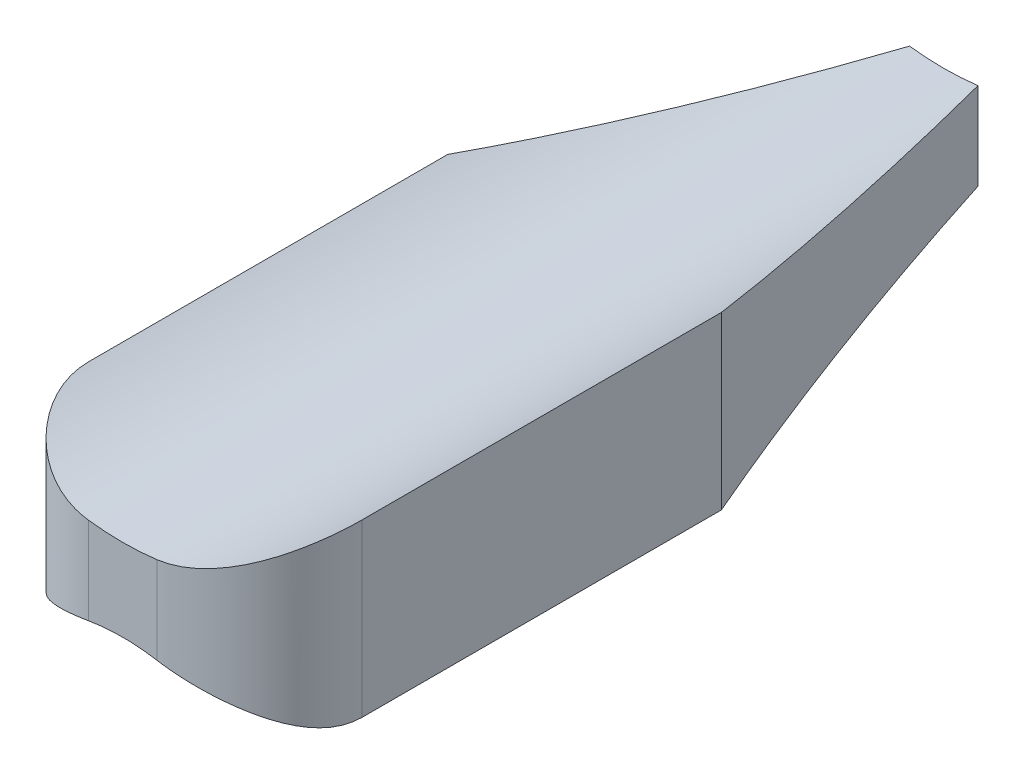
ISO-10303-21;
HEADER;
FILE_DESCRIPTION(('STEP AP214'),'2;1');
FILE_NAME('part.step','',(''),(''),'','','');
FILE_SCHEMA(('AUTOMOTIVE_DESIGN { 1 0 10303 214 1 1 1 1 }'));
ENDSEC;
DATA;
#1=APPLICATION_CONTEXT('core data for automotive mechanical design processes');
#2=APPLICATION_PROTOCOL_DEFINITION('international standard','automotive_design',2000,#1);
#3=PRODUCT_CONTEXT('',#1,'mechanical');
#4=PRODUCT('Part','Part','',(#3));
#5=PRODUCT_RELATED_PRODUCT_CATEGORY('part','',(#4));
#6=PRODUCT_DEFINITION_FORMATION('','',#4);
#7=PRODUCT_DEFINITION_CONTEXT('part definition',#1,'design');
#8=PRODUCT_DEFINITION('design','',#6,#7);
#9=PRODUCT_DEFINITION_SHAPE('','',#8);
#10=(LENGTH_UNIT() NAMED_UNIT(*) SI_UNIT(.MILLI.,.METRE.));
#11=(NAMED_UNIT(*) PLANE_ANGLE_UNIT() SI_UNIT($,.RADIAN.));
#12=(NAMED_UNIT(*) SI_UNIT($,.STERADIAN.) SOLID_ANGLE_UNIT());
#13=UNCERTAINTY_MEASURE_WITH_UNIT(LENGTH_MEASURE(1.E-05),#10,'distance_accuracy_value','');
#14=(GEOMETRIC_REPRESENTATION_CONTEXT(3) GLOBAL_UNCERTAINTY_ASSIGNED_CONTEXT((#13)) GLOBAL_UNIT_ASSIGNED_CONTEXT((#10,
#11,#12)) REPRESENTATION_CONTEXT('',''));
#15=CARTESIAN_POINT('',(0.,0.,0.));
#16=DIRECTION('',(0.,0.,1.));
#17=DIRECTION('',(1.,0.,0.));
#18=AXIS2_PLACEMENT_3D('',#15,#16,#17);
#19=CARTESIAN_POINT('',(0.,0.,304.8));
#20=DIRECTION('',(1.,0.,0.));
#21=DIRECTION('',(0.,0.,-1.));
#22=AXIS2_PLACEMENT_3D('',#19,#20,#21);
#23=PLANE('',#22);
#24=DIRECTION('',(0.,-1.,0.));
#25=VECTOR('',#24,1.);
#26=CARTESIAN_POINT('',(-1.07552855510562E-13,66.1597204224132,133.35));
#27=LINE('',#26,#25);
#28=CARTESIAN_POINT('',(-1.07552855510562E-13,63.5,133.35));
#29=VERTEX_POINT('',#28);
#30=CARTESIAN_POINT('',(-1.07552855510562E-13,0.,133.35));
#31=VERTEX_POINT('',#30);
#32=EDGE_CURVE('E104',#29,#31,#27,.T.);
#33=ORIENTED_EDGE('',*,*,#32,.T.);
#34=DIRECTION('',(0.,0.,-1.));
#35=VECTOR('',#34,1.);
#36=CARTESIAN_POINT('',(0.,0.,304.8));
#37=LINE('',#36,#35);
#38=CARTESIAN_POINT('',(0.,0.,266.7));
#39=VERTEX_POINT('',#38);
#40=EDGE_CURVE('E113',#39,#31,#37,.T.);
#41=ORIENTED_EDGE('',*,*,#40,.F.);
#42=DIRECTION('',(0.,-1.,0.));
#43=VECTOR('',#42,1.);
#44=CARTESIAN_POINT('',(0.,0.,266.7));
#45=LINE('',#44,#43);
#46=CARTESIAN_POINT('',(0.,63.5,266.7));
#47=VERTEX_POINT('',#46);
#48=EDGE_CURVE('E237',#39,#47,#45,.F.);
#49=ORIENTED_EDGE('',*,*,#48,.T.);
#50=DIRECTION('',(0.,0.,-1.));
#51=VECTOR('',#50,1.);
#52=CARTESIAN_POINT('',(0.,63.5,304.8));
#53=LINE('',#52,#51);
#54=EDGE_CURVE('E116',#47,#29,#53,.T.);
#55=ORIENTED_EDGE('',*,*,#54,.T.);
#56=EDGE_LOOP('',(#33,#41,#49,#55));
#57=FACE_BOUND('',#56,.T.);
#58=ADVANCED_FACE('F39',(#57),#23,.F.);
#59=CARTESIAN_POINT('',(101.6,0.,304.8));
#60=DIRECTION('',(-1.,0.,0.));
#61=DIRECTION('',(0.,0.,1.));
#62=AXIS2_PLACEMENT_3D('',#59,#60,#61);
#63=PLANE('',#62);
#64=DIRECTION('',(0.,-1.,0.));
#65=VECTOR('',#64,1.);
#66=CARTESIAN_POINT('',(101.6,66.1597204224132,133.35));
#67=LINE('',#66,#65);
#68=CARTESIAN_POINT('',(101.6,63.5,133.35));
#69=VERTEX_POINT('',#68);
#70=CARTESIAN_POINT('',(101.6,0.,133.35));
#71=VERTEX_POINT('',#70);
#72=EDGE_CURVE('E56',#69,#71,#67,.T.);
#73=ORIENTED_EDGE('',*,*,#72,.F.);
#74=DIRECTION('',(0.,0.,-1.));
#75=VECTOR('',#74,1.);
#76=CARTESIAN_POINT('',(101.6,63.5,304.8));
#77=LINE('',#76,#75);
#78=CARTESIAN_POINT('',(101.6,63.5,266.7));
#79=VERTEX_POINT('',#78);
#80=EDGE_CURVE('E133',#79,#69,#77,.T.);
#81=ORIENTED_EDGE('',*,*,#80,.F.);
#82=DIRECTION('',(0.,1.,0.));
#83=VECTOR('',#82,1.);
#84=CARTESIAN_POINT('',(101.6,0.,266.7));
#85=LINE('',#84,#83);
#86=CARTESIAN_POINT('',(101.6,0.,266.7));
#87=VERTEX_POINT('',#86);
#88=EDGE_CURVE('E183',#79,#87,#85,.F.);
#89=ORIENTED_EDGE('',*,*,#88,.T.);
#90=DIRECTION('',(0.,0.,-1.));
#91=VECTOR('',#90,1.);
#92=CARTESIAN_POINT('',(101.6,0.,304.8));
#93=LINE('',#92,#91);
#94=EDGE_CURVE('E125',#87,#71,#93,.T.);
#95=ORIENTED_EDGE('',*,*,#94,.T.);
#96=EDGE_LOOP('',(#73,#81,#89,#95));
#97=FACE_BOUND('',#96,.T.);
#98=ADVANCED_FACE('F192',(#97),#63,.F.);
#99=CARTESIAN_POINT('',(0.,0.,0.));
#100=DIRECTION('',(0.,0.,-1.));
#101=DIRECTION('',(-1.,0.,0.));
#102=AXIS2_PLACEMENT_3D('',#99,#100,#101);
#103=PLANE('',#102);
#104=CARTESIAN_POINT('',(50.8000000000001,-56.7961266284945,0.));
#105=DIRECTION('',(0.,0.,1.));
#106=DIRECTION('',(1.,0.,0.));
#107=AXIS2_PLACEMENT_3D('',#104,#105,#106);
#108=CIRCLE('',#107,76.2);
#109=CARTESIAN_POINT('',(63.5,18.3380866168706,0.));
#110=VERTEX_POINT('',#109);
#111=CARTESIAN_POINT('',(38.1,18.3380866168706,0.));
#112=VERTEX_POINT('',#111);
#113=EDGE_CURVE('E200',#110,#112,#108,.T.);
#114=ORIENTED_EDGE('',*,*,#113,.T.);
#115=DIRECTION('',(0.,-1.,0.));
#116=VECTOR('',#115,1.);
#117=CARTESIAN_POINT('',(38.1,66.1597204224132,0.));
#118=LINE('',#117,#116);
#119=CARTESIAN_POINT('',(38.1,50.6850560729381,0.));
#120=VERTEX_POINT('',#119);
#121=EDGE_CURVE('E63',#120,#112,#118,.T.);
#122=ORIENTED_EDGE('',*,*,#121,.F.);
#123=CARTESIAN_POINT('',(50.8,151.488181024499,0.));
#124=DIRECTION('',(0.,0.,1.));
#125=DIRECTION('',(1.,0.,0.));
#126=AXIS2_PLACEMENT_3D('',#123,#124,#125);
#127=CIRCLE('',#126,101.6);
#128=CARTESIAN_POINT('',(63.5,50.6850560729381,0.));
#129=VERTEX_POINT('',#128);
#130=EDGE_CURVE('E211',#120,#129,#127,.T.);
#131=ORIENTED_EDGE('',*,*,#130,.T.);
#132=DIRECTION('',(0.,-1.,0.));
#133=VECTOR('',#132,1.);
#134=CARTESIAN_POINT('',(63.5,66.1597204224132,0.));
#135=LINE('',#134,#133);
#136=EDGE_CURVE('E203',#129,#110,#135,.T.);
#137=ORIENTED_EDGE('',*,*,#136,.T.);
#138=EDGE_LOOP('',(#114,#122,#131,#137));
#139=FACE_BOUND('',#138,.T.);
#140=ADVANCED_FACE('F165',(#139),#103,.T.);
#141=CARTESIAN_POINT('',(50.8,151.488181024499,0.));
#142=DIRECTION('',(0.,0.,1.));
#143=DIRECTION('',(1.,0.,0.));
#144=AXIS2_PLACEMENT_3D('',#141,#142,#143);
#145=CYLINDRICAL_SURFACE('',#144,101.6);
#146=CARTESIAN_POINT('',(50.8,151.488181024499,-44.4499999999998));
#147=DIRECTION('',(-0.961523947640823,0.,-0.274721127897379));
#148=DIRECTION('',(-0.274721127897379,0.,0.961523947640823));
#149=AXIS2_PLACEMENT_3D('',#146,#147,#148);
#150=ELLIPSE('',#149,369.829582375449,101.6);
#151=EDGE_CURVE('E213',#29,#120,#150,.F.);
#152=ORIENTED_EDGE('',*,*,#151,.F.);
#153=ORIENTED_EDGE('',*,*,#54,.F.);
#154=CARTESIAN_POINT('',(0.,63.5,266.7));
#155=CARTESIAN_POINT('',(-1.13735460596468E-05,63.5000154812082,267.195606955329));
#156=CARTESIAN_POINT('',(0.00967013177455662,63.4944171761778,267.691205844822));
#157=CARTESIAN_POINT('',(0.0483327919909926,63.4721075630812,268.681382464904));
#158=CARTESIAN_POINT('',(0.0773132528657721,63.4553966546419,269.175960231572));
#159=CARTESIAN_POINT('',(0.154467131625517,63.4109882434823,270.162861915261));
#160=CARTESIAN_POINT('',(0.202630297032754,63.3832966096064,270.655186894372));
#161=CARTESIAN_POINT('',(0.317968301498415,63.317160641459,271.63684344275));
#162=CARTESIAN_POINT('',(0.385143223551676,63.2787162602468,272.126174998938));
#163=CARTESIAN_POINT('',(0.614036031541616,63.1481538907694,273.582920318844));
#164=CARTESIAN_POINT('',(0.803570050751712,63.0405452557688,274.544766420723));
#165=CARTESIAN_POINT('',(1.2546750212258,62.7870684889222,276.446145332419));
#166=CARTESIAN_POINT('',(1.5162529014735,62.6411966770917,277.385675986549));
#167=CARTESIAN_POINT('',(2.10793269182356,62.3155602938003,279.234814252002));
#168=CARTESIAN_POINT('',(2.43790355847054,62.1358605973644,280.144475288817));
#169=CARTESIAN_POINT('',(3.16339361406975,61.7469810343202,281.930656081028));
#170=CARTESIAN_POINT('',(3.55891221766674,61.5378014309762,282.807176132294));
#171=CARTESIAN_POINT('',(4.41267057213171,61.0945574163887,284.523976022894));
#172=CARTESIAN_POINT('',(4.87098979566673,60.8604615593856,285.364208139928));
#173=CARTESIAN_POINT('',(5.8466190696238,60.3725897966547,287.003681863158));
#174=CARTESIAN_POINT('',(6.36393179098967,60.1188130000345,287.802921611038));
#175=CARTESIAN_POINT('',(7.49590848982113,59.5765994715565,289.41659140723));
#176=CARTESIAN_POINT('',(8.11498769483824,59.2869953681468,290.227533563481));
#177=CARTESIAN_POINT('',(9.41389112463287,58.6967003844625,291.794884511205));
#178=CARTESIAN_POINT('',(10.0937178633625,58.3960090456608,292.551291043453));
#179=CARTESIAN_POINT('',(11.5107049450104,57.7891657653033,294.006614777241));
#180=CARTESIAN_POINT('',(12.2478881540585,57.4830116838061,294.705508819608));
#181=CARTESIAN_POINT('',(13.775715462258,56.8708482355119,296.042283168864));
#182=CARTESIAN_POINT('',(14.566361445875,56.5648388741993,296.680161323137));
#183=CARTESIAN_POINT('',(16.2741254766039,55.9296659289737,297.948620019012));
#184=CARTESIAN_POINT('',(17.1961462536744,55.6010289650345,298.5728811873));
#185=CARTESIAN_POINT('',(19.094699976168,54.9566374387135,299.740133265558));
#186=CARTESIAN_POINT('',(20.0712385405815,54.6408842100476,300.283115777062));
#187=CARTESIAN_POINT('',(22.0720533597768,54.028658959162,301.282716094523));
#188=CARTESIAN_POINT('',(23.096280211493,53.7321677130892,301.739420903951));
#189=CARTESIAN_POINT('',(25.1868616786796,53.1637194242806,302.562546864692));
#190=CARTESIAN_POINT('',(26.2532080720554,52.891757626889,302.928985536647));
#191=CARTESIAN_POINT('',(28.2005240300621,52.4295507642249,303.502461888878));
#192=CARTESIAN_POINT('',(29.0751742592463,52.2339253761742,303.726757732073));
#193=CARTESIAN_POINT('',(30.8422794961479,51.8635656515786,304.11327644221));
#194=CARTESIAN_POINT('',(31.7347307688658,51.6888269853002,304.275512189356));
#195=CARTESIAN_POINT('',(33.53467536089,51.3617289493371,304.536437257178));
#196=CARTESIAN_POINT('',(34.4421921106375,51.2094089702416,304.635015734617));
#197=CARTESIAN_POINT('',(35.8098118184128,50.9990399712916,304.733856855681));
#198=CARTESIAN_POINT('',(36.2668782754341,50.9319183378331,304.758632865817));
#199=CARTESIAN_POINT('',(37.1824820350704,50.8038377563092,304.791705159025));
#200=CARTESIAN_POINT('',(37.6410193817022,50.7428789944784,304.800000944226));
#201=CARTESIAN_POINT('',(38.1,50.6850560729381,304.8));
#202=B_SPLINE_CURVE_WITH_KNOTS('',3,(#154,#155,#156,#157,#158,#159,#160,#161,#162,#163,#164,
#165,#166,#167,#168,#169,#170,#171,#172,#173,#174,#175,#176,#177,#178,#179,#180,#181,#182,#183,
#184,#185,#186,#187,#188,#189,#190,#191,#192,#193,#194,#195,#196,#197,#198,#199,#200,#201),
.UNSPECIFIED.,.F.,.F.,(4,2,2,2,2,2,2,2,2,2,2,2,2,2,2,2,2,2,2,2,2,2,2,4),(0.,1.4866802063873,
2.97330695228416,4.45914021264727,5.94497995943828,8.89960350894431,11.8545113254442,
14.8038089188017,17.7530801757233,20.7061187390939,23.6592910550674,26.8376240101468,
30.0160885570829,33.195826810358,36.3756772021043,39.8543611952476,43.3334043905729,
46.8089203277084,50.283761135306,53.0531003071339,55.8218644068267,58.5954367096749,
59.9830419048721,61.370689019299),.UNSPECIFIED.);
#203=CARTESIAN_POINT('',(38.1,50.6850560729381,304.8));
#204=VERTEX_POINT('',#203);
#205=EDGE_CURVE('E176',#47,#204,#202,.T.);
#206=ORIENTED_EDGE('',*,*,#205,.T.);
#207=CARTESIAN_POINT('',(50.8,151.488181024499,304.8));
#208=DIRECTION('',(0.,0.,1.));
#209=DIRECTION('',(1.,0.,0.));
#210=AXIS2_PLACEMENT_3D('',#207,#208,#209);
#211=CIRCLE('',#210,101.6);
#212=CARTESIAN_POINT('',(63.5,50.6850560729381,304.8));
#213=VERTEX_POINT('',#212);
#214=EDGE_CURVE('E205',#204,#213,#211,.T.);
#215=ORIENTED_EDGE('',*,*,#214,.T.);
#216=CARTESIAN_POINT('',(63.5,50.6850560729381,304.8));
#217=CARTESIAN_POINT('',(64.0334467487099,50.7522536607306,304.800009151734));
#218=CARTESIAN_POINT('',(64.5663448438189,50.8237043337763,304.788796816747));
#219=CARTESIAN_POINT('',(65.6300048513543,50.9749035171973,304.744135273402));
#220=CARTESIAN_POINT('',(66.1607668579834,51.0546516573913,304.710687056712));
#221=CARTESIAN_POINT('',(67.2189252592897,51.2222057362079,304.621779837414));
#222=CARTESIAN_POINT('',(67.746323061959,51.3100080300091,304.566330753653));
#223=CARTESIAN_POINT('',(68.7969786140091,51.4934146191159,304.433704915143));
#224=CARTESIAN_POINT('',(69.3202363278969,51.5890189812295,304.356527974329));
#225=CARTESIAN_POINT('',(70.8782878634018,51.8862926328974,304.093540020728));
#226=CARTESIAN_POINT('',(71.9057840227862,52.0991257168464,303.875896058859));
#227=CARTESIAN_POINT('',(73.9337454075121,52.551484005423,303.358459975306));
#228=CARTESIAN_POINT('',(74.9342081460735,52.7910116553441,303.058660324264));
#229=CARTESIAN_POINT('',(76.9005742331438,53.2927232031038,302.380728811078));
#230=CARTESIAN_POINT('',(77.866527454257,53.5548723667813,302.002715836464));
#231=CARTESIAN_POINT('',(79.7599916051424,54.0979909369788,301.171608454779));
#232=CARTESIAN_POINT('',(80.6875031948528,54.3789600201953,300.718515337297));
#233=CARTESIAN_POINT('',(82.5002427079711,54.9554913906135,299.740317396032));
#234=CARTESIAN_POINT('',(83.3854276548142,55.2510679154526,299.215141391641));
#235=CARTESIAN_POINT('',(85.1082463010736,55.8516993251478,298.096633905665));
#236=CARTESIAN_POINT('',(85.9458780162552,56.1567546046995,297.503299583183));
#237=CARTESIAN_POINT('',(87.6173121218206,56.7892365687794,296.215129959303));
#238=CARTESIAN_POINT('',(88.4480020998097,57.1169251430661,295.516380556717));
#239=CARTESIAN_POINT('',(90.0471562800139,57.7706955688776,294.050234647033));
#240=CARTESIAN_POINT('',(90.8156177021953,58.096777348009,293.282835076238));
#241=CARTESIAN_POINT('',(92.2862155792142,58.7406818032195,291.68289290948));
#242=CARTESIAN_POINT('',(92.9883187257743,59.0585002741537,290.850317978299));
#243=CARTESIAN_POINT('',(94.3211625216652,59.6785477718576,289.124422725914));
#244=CARTESIAN_POINT('',(94.9519043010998,59.980777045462,288.231103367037));
#245=CARTESIAN_POINT('',(96.1510668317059,60.5690014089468,286.366587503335));
#246=CARTESIAN_POINT('',(96.7176913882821,60.8544536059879,285.394060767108));
#247=CARTESIAN_POINT('',(97.7658042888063,61.393116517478,283.395454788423));
#248=CARTESIAN_POINT('',(98.2472829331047,61.6463235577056,282.369369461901));
#249=CARTESIAN_POINT('',(99.1185987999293,62.1119147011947,280.27242764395));
#250=CARTESIAN_POINT('',(99.5086312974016,62.3243856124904,279.201672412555));
#251=CARTESIAN_POINT('',(100.02173105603,62.6072548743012,277.567362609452));
#252=CARTESIAN_POINT('',(100.180766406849,62.6955681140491,277.017925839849));
#253=CARTESIAN_POINT('',(100.474329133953,62.8594647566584,275.910691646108));
#254=CARTESIAN_POINT('',(100.608859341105,62.9350496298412,275.352895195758));
#255=CARTESIAN_POINT('',(100.874417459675,63.0849006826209,274.13100256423));
#256=CARTESIAN_POINT('',(101.000628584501,63.1565752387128,273.465534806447));
#257=CARTESIAN_POINT('',(101.217564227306,63.2802182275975,272.127228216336));
#258=CARTESIAN_POINT('',(101.30829920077,63.3321924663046,271.454391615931));
#259=CARTESIAN_POINT('',(101.453836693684,63.4157318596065,270.102738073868));
#260=CARTESIAN_POINT('',(101.508595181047,63.4472720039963,269.423914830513));
#261=CARTESIAN_POINT('',(101.581705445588,63.4894386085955,268.063401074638));
#262=CARTESIAN_POINT('',(101.600043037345,63.5000569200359,267.381709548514));
#263=CARTESIAN_POINT('',(101.6,63.5,266.7));
#264=B_SPLINE_CURVE_WITH_KNOTS('',3,(#216,#217,#218,#219,#220,#221,#222,#223,#224,#225,#226,
#227,#228,#229,#230,#231,#232,#233,#234,#235,#236,#237,#238,#239,#240,#241,#242,#243,#244,#245,
#246,#247,#248,#249,#250,#251,#252,#253,#254,#255,#256,#257,#258,#259,#260,#261,#262,#263),
.UNSPECIFIED.,.F.,.F.,(4,2,2,2,2,2,2,2,2,2,2,2,2,2,2,2,2,2,2,2,2,2,2,4),(0.,1.61283234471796,
3.22559276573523,4.83762691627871,6.44967487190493,9.6603305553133,12.8712805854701,
16.0773852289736,19.2834348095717,22.4926733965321,25.7020457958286,29.0998526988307,
32.4978113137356,35.8974665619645,39.2970679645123,42.7759427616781,46.2552136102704,
49.7269857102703,51.4626911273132,53.198195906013,55.240279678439,57.2817611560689,
59.3257365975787,61.3705079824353),.UNSPECIFIED.);
#265=EDGE_CURVE('E170',#213,#79,#264,.T.);
#266=ORIENTED_EDGE('',*,*,#265,.T.);
#267=ORIENTED_EDGE('',*,*,#80,.T.);
#268=CARTESIAN_POINT('',(50.8,151.488181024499,-44.45));
#269=DIRECTION('',(0.961523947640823,0.,-0.274721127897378));
#270=DIRECTION('',(0.274721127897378,0.,0.961523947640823));
#271=AXIS2_PLACEMENT_3D('',#268,#269,#270);
#272=ELLIPSE('',#271,369.82958237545,101.6);
#273=EDGE_CURVE('E118',#129,#69,#272,.F.);
#274=ORIENTED_EDGE('',*,*,#273,.F.);
#275=ORIENTED_EDGE('',*,*,#130,.F.);
#276=EDGE_LOOP('',(#152,#153,#206,#215,#266,#267,#274,#275));
#277=FACE_BOUND('',#276,.T.);
#278=ADVANCED_FACE('F158',(#277),#145,.F.);
#279=CARTESIAN_POINT('',(50.8000000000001,-56.7961266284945,0.));
#280=DIRECTION('',(0.,0.,1.));
#281=DIRECTION('',(1.,0.,0.));
#282=AXIS2_PLACEMENT_3D('',#279,#280,#281);
#283=CYLINDRICAL_SURFACE('',#282,76.2);
#284=CARTESIAN_POINT('',(50.8000000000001,-56.7961266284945,-44.4500000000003));
#285=DIRECTION('',(-0.961523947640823,0.,-0.274721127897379));
#286=DIRECTION('',(-0.274721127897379,0.,0.961523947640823));
#287=AXIS2_PLACEMENT_3D('',#284,#285,#286);
#288=ELLIPSE('',#287,277.372186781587,76.2);
#289=EDGE_CURVE('E11',#112,#31,#288,.F.);
#290=ORIENTED_EDGE('',*,*,#289,.F.);
#291=ORIENTED_EDGE('',*,*,#113,.F.);
#292=CARTESIAN_POINT('',(50.8000000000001,-56.7961266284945,-44.4499999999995));
#293=DIRECTION('',(0.961523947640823,0.,-0.274721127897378));
#294=DIRECTION('',(0.274721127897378,0.,0.961523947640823));
#295=AXIS2_PLACEMENT_3D('',#292,#293,#294);
#296=ELLIPSE('',#295,277.372186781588,76.2);
#297=EDGE_CURVE('E49',#71,#110,#296,.F.);
#298=ORIENTED_EDGE('',*,*,#297,.F.);
#299=ORIENTED_EDGE('',*,*,#94,.F.);
#300=CARTESIAN_POINT('',(101.6,0.,266.7));
#301=CARTESIAN_POINT('',(101.600015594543,-2.79525179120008E-05,267.162009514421));
#302=CARTESIAN_POINT('',(101.591596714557,0.00751577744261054,267.624006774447));
#303=CARTESIAN_POINT('',(101.558007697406,0.0375392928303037,268.546868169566));
#304=CARTESIAN_POINT('',(101.532838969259,0.0600178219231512,269.007732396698));
#305=CARTESIAN_POINT('',(101.465906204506,0.119669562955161,269.926771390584));
#306=CARTESIAN_POINT('',(101.424161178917,0.156825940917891,270.384948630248));
#307=CARTESIAN_POINT('',(101.324311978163,0.245422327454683,271.298095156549));
#308=CARTESIAN_POINT('',(101.266207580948,0.296862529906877,271.753064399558));
#309=CARTESIAN_POINT('',(101.06901612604,0.470766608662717,273.103151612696));
#310=CARTESIAN_POINT('',(100.906387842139,0.613413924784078,273.992411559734));
#311=CARTESIAN_POINT('',(100.520891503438,0.947597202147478,275.7483377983));
#312=CARTESIAN_POINT('',(100.298008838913,1.13914501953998,276.614998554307));
#313=CARTESIAN_POINT('',(99.7965592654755,1.56382973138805,278.316934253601));
#314=CARTESIAN_POINT('',(99.5182526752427,1.79677167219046,279.152335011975));
#315=CARTESIAN_POINT('',(98.908745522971,2.29824039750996,280.792418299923));
#316=CARTESIAN_POINT('',(98.5775468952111,2.56676588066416,281.597101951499));
#317=CARTESIAN_POINT('',(97.8645926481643,3.13359826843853,283.175326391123));
#318=CARTESIAN_POINT('',(97.4827187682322,3.43197442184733,283.948788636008));
#319=CARTESIAN_POINT('',(96.6718398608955,4.05183798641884,285.461005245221));
#320=CARTESIAN_POINT('',(96.2428280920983,4.37332870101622,286.199754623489));
#321=CARTESIAN_POINT('',(95.2768045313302,5.0800428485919,287.74246105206));
#322=CARTESIAN_POINT('',(94.7330851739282,5.46787944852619,288.54102362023));
#323=CARTESIAN_POINT('',(93.5906541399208,6.25847341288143,290.089928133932));
#324=CARTESIAN_POINT('',(92.9919391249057,6.66123168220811,290.840267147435));
#325=CARTESIAN_POINT('',(91.7417310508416,7.47494918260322,292.291647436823));
#326=CARTESIAN_POINT('',(91.0902105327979,7.88591259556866,292.992662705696));
#327=CARTESIAN_POINT('',(89.7368489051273,8.70951809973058,294.343296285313));
#328=CARTESIAN_POINT('',(89.0350039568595,9.12216031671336,294.99291066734));
#329=CARTESIAN_POINT('',(87.4399085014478,10.0241803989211,296.36145521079));
#330=CARTESIAN_POINT('',(86.5361880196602,10.5126619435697,297.068831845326));
#331=CARTESIAN_POINT('',(84.6629897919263,11.4742662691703,298.402680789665));
#332=CARTESIAN_POINT('',(83.6935030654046,11.947386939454,299.029142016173));
#333=CARTESIAN_POINT('',(81.6945246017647,12.8686237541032,300.194860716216));
#334=CARTESIAN_POINT('',(80.6651323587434,13.3167790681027,300.734257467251));
#335=CARTESIAN_POINT('',(78.5500146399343,14.1804954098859,301.720969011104));
#336=CARTESIAN_POINT('',(77.4642955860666,14.5960601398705,302.168294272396));
#337=CARTESIAN_POINT('',(75.3492597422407,15.3489441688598,302.926287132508));
#338=CARTESIAN_POINT('',(74.3244628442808,15.6899458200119,303.245927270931));
#339=CARTESIAN_POINT('',(72.2402256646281,16.3335170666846,303.799595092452));
#340=CARTESIAN_POINT('',(71.1807945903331,16.63609677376,304.033645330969));
#341=CARTESIAN_POINT('',(69.5683828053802,17.0584588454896,304.317620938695));
#342=CARTESIAN_POINT('',(69.0253217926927,17.1943652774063,304.401249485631));
#343=CARTESIAN_POINT('',(67.9333769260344,17.4548143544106,304.545188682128));
#344=CARTESIAN_POINT('',(67.3844931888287,17.5793572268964,304.605499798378));
#345=CARTESIAN_POINT('',(66.2815836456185,17.8167337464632,304.702361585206));
#346=CARTESIAN_POINT('',(65.727553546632,17.9295564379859,304.738890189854));
#347=CARTESIAN_POINT('',(64.6160426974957,18.143034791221,304.787717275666));
#348=CARTESIAN_POINT('',(64.0585616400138,18.2436893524,304.800013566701));
#349=CARTESIAN_POINT('',(63.5,18.3380866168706,304.8));
#350=B_SPLINE_CURVE_WITH_KNOTS('',3,(#300,#301,#302,#303,#304,#305,#306,#307,#308,#309,#310,
#311,#312,#313,#314,#315,#316,#317,#318,#319,#320,#321,#322,#323,#324,#325,#326,#327,#328,#329,
#330,#331,#332,#333,#334,#335,#336,#337,#338,#339,#340,#341,#342,#343,#344,#345,#346,#347,#348,
#349),.UNSPECIFIED.,.F.,.F.,(4,2,2,2,2,2,2,2,2,2,2,2,2,2,2,2,2,2,2,2,2,2,2,2,4),(0.,
1.38586912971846,2.7716216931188,4.15578953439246,5.53997616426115,8.28143557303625,
11.0235602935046,13.7530971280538,16.4825341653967,19.2184567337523,21.9547710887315,
25.0750194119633,28.1954572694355,31.3175283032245,34.4398377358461,38.1772061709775,
41.9150859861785,45.6469257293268,49.3783409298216,52.7533002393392,56.1273695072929,
57.82491828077,59.5224330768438,61.221520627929,62.9207617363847),.UNSPECIFIED.);
#351=CARTESIAN_POINT('',(63.5,18.3380866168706,304.8));
#352=VERTEX_POINT('',#351);
#353=EDGE_CURVE('E140',#87,#352,#350,.T.);
#354=ORIENTED_EDGE('',*,*,#353,.T.);
#355=CARTESIAN_POINT('',(50.8000000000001,-56.7961266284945,304.8));
#356=DIRECTION('',(0.,0.,1.));
#357=DIRECTION('',(1.,0.,0.));
#358=AXIS2_PLACEMENT_3D('',#355,#356,#357);
#359=CIRCLE('',#358,76.2);
#360=CARTESIAN_POINT('',(38.1,18.3380866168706,304.8));
#361=VERTEX_POINT('',#360);
#362=EDGE_CURVE('E206',#352,#361,#359,.T.);
#363=ORIENTED_EDGE('',*,*,#362,.T.);
#364=CARTESIAN_POINT('',(38.1,18.3380866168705,304.8));
#365=CARTESIAN_POINT('',(37.5707588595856,18.2486421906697,304.800011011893));
#366=CARTESIAN_POINT('',(37.0424853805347,18.1535827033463,304.788972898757));
#367=CARTESIAN_POINT('',(35.9889714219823,17.9525218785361,304.745121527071));
#368=CARTESIAN_POINT('',(35.4637307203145,17.8465213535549,304.712309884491));
#369=CARTESIAN_POINT('',(34.4176784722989,17.623933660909,304.625265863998));
#370=CARTESIAN_POINT('',(33.8968640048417,17.5073541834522,304.571048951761));
#371=CARTESIAN_POINT('',(32.860305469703,17.2639229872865,304.44160178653));
#372=CARTESIAN_POINT('',(32.3445614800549,17.1370711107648,304.366371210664));
#373=CARTESIAN_POINT('',(30.8124730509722,16.743285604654,304.11081641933));
#374=CARTESIAN_POINT('',(29.8047568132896,16.461730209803,303.900077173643));
#375=CARTESIAN_POINT('',(27.8194945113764,15.8634367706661,303.401083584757));
#376=CARTESIAN_POINT('',(26.8419533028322,15.5466931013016,303.112816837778));
#377=CARTESIAN_POINT('',(24.9250970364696,14.8834030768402,302.463848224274));
#378=CARTESIAN_POINT('',(23.9856820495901,14.5369431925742,302.103352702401));
#379=CARTESIAN_POINT('',(22.1465878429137,13.8182970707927,301.31358529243));
#380=CARTESIAN_POINT('',(21.2469072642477,13.4461117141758,300.884315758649));
#381=CARTESIAN_POINT('',(19.4892514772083,12.6804699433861,299.960150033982));
#382=CARTESIAN_POINT('',(18.6313479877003,12.2869792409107,299.465146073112));
#383=CARTESIAN_POINT('',(16.9616689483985,11.4846571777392,298.413632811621));
#384=CARTESIAN_POINT('',(16.1498959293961,11.0758249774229,297.857120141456));
#385=CARTESIAN_POINT('',(14.4930594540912,10.2054414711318,296.624841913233));
#386=CARTESIAN_POINT('',(13.6532962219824,9.74282508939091,295.942693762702));
#387=CARTESIAN_POINT('',(12.0358169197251,8.81369106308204,294.510704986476));
#388=CARTESIAN_POINT('',(11.2581076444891,8.34717299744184,293.760856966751));
#389=CARTESIAN_POINT('',(9.76737955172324,7.41863451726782,292.19590413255));
#390=CARTESIAN_POINT('',(9.05439524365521,6.95661661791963,291.380764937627));
#391=CARTESIAN_POINT('',(7.6969910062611,6.04683599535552,289.687907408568));
#392=CARTESIAN_POINT('',(7.05256179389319,5.59907134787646,288.810197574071));
#393=CARTESIAN_POINT('',(5.91371249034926,4.78380056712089,287.109859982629));
#394=CARTESIAN_POINT('',(5.41063929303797,4.41333342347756,286.294442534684));
#395=CARTESIAN_POINT('',(4.46301906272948,3.69913076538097,284.618973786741));
#396=CARTESIAN_POINT('',(4.01847004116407,3.35539434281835,283.758924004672));
#397=CARTESIAN_POINT('',(3.19332303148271,2.70445808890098,281.999495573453));
#398=CARTESIAN_POINT('',(2.81249934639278,2.39713048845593,281.100270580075));
#399=CARTESIAN_POINT('',(2.11734866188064,1.82675145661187,279.262767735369));
#400=CARTESIAN_POINT('',(1.80301450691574,1.56369526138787,278.324494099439));
#401=CARTESIAN_POINT('',(1.27767095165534,1.11832380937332,276.523555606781));
#402=CARTESIAN_POINT('',(1.05894250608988,0.930206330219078,275.664576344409));
#403=CARTESIAN_POINT('',(0.68067498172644,0.602099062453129,273.924661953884));
#404=CARTESIAN_POINT('',(0.521117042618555,0.462093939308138,273.043733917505));
#405=CARTESIAN_POINT('',(0.327615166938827,0.29139927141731,271.706294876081));
#406=CARTESIAN_POINT('',(0.27058271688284,0.240898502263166,271.255473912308));
#407=CARTESIAN_POINT('',(0.172579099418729,0.153926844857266,270.350710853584));
#408=CARTESIAN_POINT('',(0.131607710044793,0.117455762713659,269.896768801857));
#409=CARTESIAN_POINT('',(0.0659148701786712,0.0589051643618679,268.986243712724));
#410=CARTESIAN_POINT('',(0.0412128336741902,0.0368428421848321,268.529658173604));
#411=CARTESIAN_POINT('',(0.00824722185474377,0.00737620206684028,267.615385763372));
#412=CARTESIAN_POINT('',(-1.50073458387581E-05,-2.6915557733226E-05,267.157698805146));
#413=CARTESIAN_POINT('',(0.,0.,266.7));
#414=B_SPLINE_CURVE_WITH_KNOTS('',3,(#364,#365,#366,#367,#368,#369,#370,#371,#372,#373,#374,
#375,#376,#377,#378,#379,#380,#381,#382,#383,#384,#385,#386,#387,#388,#389,#390,#391,#392,#393,
#394,#395,#396,#397,#398,#399,#400,#401,#402,#403,#404,#405,#406,#407,#408,#409,#410,#411,#412,
#413),.UNSPECIFIED.,.F.,.F.,(4,2,2,2,2,2,2,2,2,2,2,2,2,2,2,2,2,2,2,2,2,2,2,2,4),(0.,
1.61006554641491,3.22001161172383,4.82879658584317,6.4376062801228,9.63524030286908,
12.8333862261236,16.0225226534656,19.2115499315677,22.4058716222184,25.6003683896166,
29.126675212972,32.6533676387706,36.1819294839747,39.7100129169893,42.7889982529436,
45.8678789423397,48.9356130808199,52.0030169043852,54.718284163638,57.4326851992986,
58.8038999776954,60.1750958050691,61.5479249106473,62.920866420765),.UNSPECIFIED.);
#415=EDGE_CURVE('E122',#361,#39,#414,.T.);
#416=ORIENTED_EDGE('',*,*,#415,.T.);
#417=ORIENTED_EDGE('',*,*,#40,.T.);
#418=EDGE_LOOP('',(#290,#291,#298,#299,#354,#363,#416,#417));
#419=FACE_BOUND('',#418,.T.);
#420=ADVANCED_FACE('F120',(#419),#283,.F.);
#421=CARTESIAN_POINT('',(0.,0.,304.8));
#422=DIRECTION('',(0.,0.,-1.));
#423=DIRECTION('',(-1.,0.,0.));
#424=AXIS2_PLACEMENT_3D('',#421,#422,#423);
#425=PLANE('',#424);
#426=ORIENTED_EDGE('',*,*,#214,.F.);
#427=DIRECTION('',(0.,-1.,0.));
#428=VECTOR('',#427,1.);
#429=CARTESIAN_POINT('',(38.1,0.,304.8));
#430=LINE('',#429,#428);
#431=EDGE_CURVE('E130',#204,#361,#430,.T.);
#432=ORIENTED_EDGE('',*,*,#431,.T.);
#433=ORIENTED_EDGE('',*,*,#362,.F.);
#434=DIRECTION('',(0.,1.,0.));
#435=VECTOR('',#434,1.);
#436=CARTESIAN_POINT('',(63.5,0.,304.8));
#437=LINE('',#436,#435);
#438=EDGE_CURVE('E124',#352,#213,#437,.T.);
#439=ORIENTED_EDGE('',*,*,#438,.T.);
#440=EDGE_LOOP('',(#426,#432,#433,#439));
#441=FACE_BOUND('',#440,.T.);
#442=ADVANCED_FACE('F157',(#441),#425,.F.);
#443=CARTESIAN_POINT('',(38.1,0.,266.7));
#444=DIRECTION('',(0.,-1.,0.));
#445=DIRECTION('',(0.,0.,-1.));
#446=AXIS2_PLACEMENT_3D('',#443,#444,#445);
#447=CYLINDRICAL_SURFACE('',#446,38.1);
#448=ORIENTED_EDGE('',*,*,#205,.F.);
#449=ORIENTED_EDGE('',*,*,#48,.F.);
#450=ORIENTED_EDGE('',*,*,#415,.F.);
#451=ORIENTED_EDGE('',*,*,#431,.F.);
#452=EDGE_LOOP('',(#448,#449,#450,#451));
#453=FACE_BOUND('',#452,.T.);
#454=ADVANCED_FACE('F184',(#453),#447,.T.);
#455=CARTESIAN_POINT('',(63.5,0.,266.7));
#456=DIRECTION('',(0.,1.,0.));
#457=DIRECTION('',(0.,0.,1.));
#458=AXIS2_PLACEMENT_3D('',#455,#456,#457);
#459=CYLINDRICAL_SURFACE('',#458,38.1);
#460=ORIENTED_EDGE('',*,*,#353,.F.);
#461=ORIENTED_EDGE('',*,*,#88,.F.);
#462=ORIENTED_EDGE('',*,*,#265,.F.);
#463=ORIENTED_EDGE('',*,*,#438,.F.);
#464=EDGE_LOOP('',(#460,#461,#462,#463));
#465=FACE_BOUND('',#464,.T.);
#466=ADVANCED_FACE('F41',(#465),#459,.T.);
#467=CARTESIAN_POINT('',(101.6,66.1597204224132,133.35));
#468=DIRECTION('',(0.961523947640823,0.,-0.274721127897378));
#469=DIRECTION('',(-0.274721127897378,0.,-0.961523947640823));
#470=AXIS2_PLACEMENT_3D('',#467,#468,#469);
#471=PLANE('',#470);
#472=ORIENTED_EDGE('',*,*,#273,.T.);
#473=ORIENTED_EDGE('',*,*,#72,.T.);
#474=ORIENTED_EDGE('',*,*,#297,.T.);
#475=ORIENTED_EDGE('',*,*,#136,.F.);
#476=EDGE_LOOP('',(#472,#473,#474,#475));
#477=FACE_BOUND('',#476,.T.);
#478=ADVANCED_FACE('F159',(#477),#471,.T.);
#479=CARTESIAN_POINT('',(-1.07552855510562E-13,66.1597204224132,133.35));
#480=DIRECTION('',(-0.961523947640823,0.,-0.274721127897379));
#481=DIRECTION('',(-0.274721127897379,0.,0.961523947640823));
#482=AXIS2_PLACEMENT_3D('',#479,#480,#481);
#483=PLANE('',#482);
#484=ORIENTED_EDGE('',*,*,#151,.T.);
#485=ORIENTED_EDGE('',*,*,#121,.T.);
#486=ORIENTED_EDGE('',*,*,#289,.T.);
#487=ORIENTED_EDGE('',*,*,#32,.F.);
#488=EDGE_LOOP('',(#484,#485,#486,#487));
#489=FACE_BOUND('',#488,.T.);
#490=ADVANCED_FACE('F103',(#489),#483,.T.);
#491=CLOSED_SHELL('',(#58,#98,#140,#278,#420,#442,#454,#466,#478,#490));
#492=MANIFOLD_SOLID_BREP('B2',#491);
#493=ADVANCED_BREP_SHAPE_REPRESENTATION('',(#18,#492),#14);
#494=SHAPE_DEFINITION_REPRESENTATION(#9,#493);
ENDSEC;
END-ISO-10303-21;
